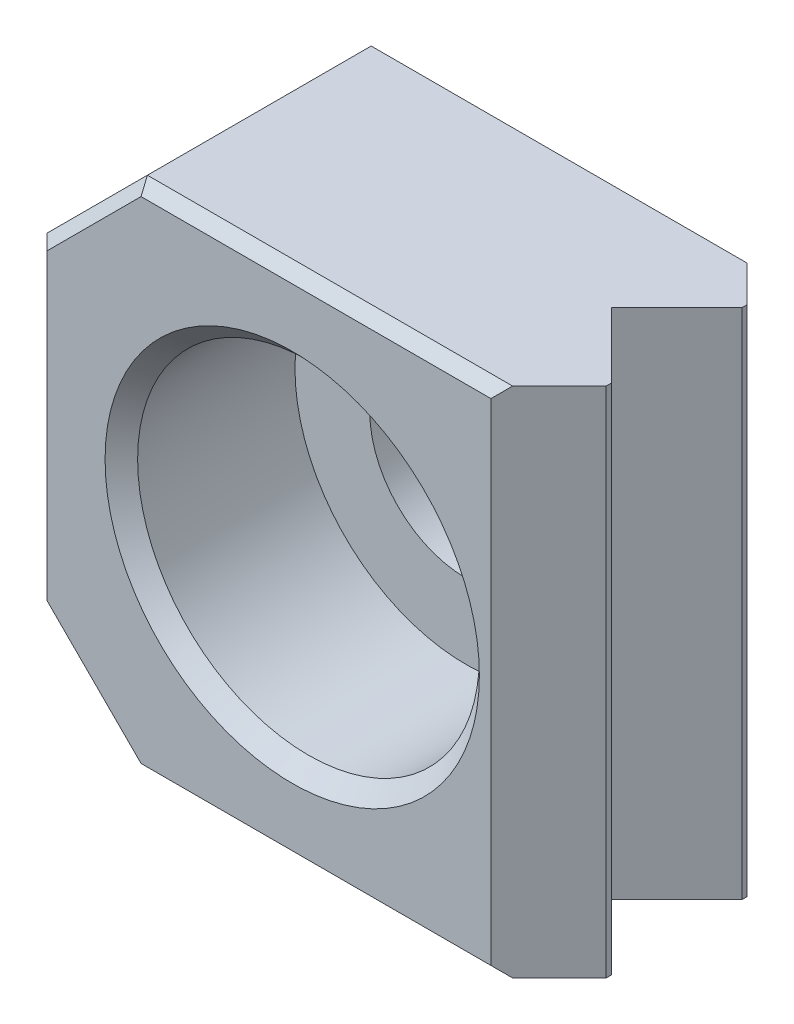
ISO-10303-21;
HEADER;
FILE_DESCRIPTION(('STEP AP214'),'2;1');
FILE_NAME('part.step','',(''),(''),'','','');
FILE_SCHEMA(('AUTOMOTIVE_DESIGN { 1 0 10303 214 1 1 1 1 }'));
ENDSEC;
DATA;
#1=APPLICATION_CONTEXT('core data for automotive mechanical design processes');
#2=APPLICATION_PROTOCOL_DEFINITION('international standard','automotive_design',2000,#1);
#3=PRODUCT_CONTEXT('',#1,'mechanical');
#4=PRODUCT('Part','Part','',(#3));
#5=PRODUCT_RELATED_PRODUCT_CATEGORY('part','',(#4));
#6=PRODUCT_DEFINITION_FORMATION('','',#4);
#7=PRODUCT_DEFINITION_CONTEXT('part definition',#1,'design');
#8=PRODUCT_DEFINITION('design','',#6,#7);
#9=PRODUCT_DEFINITION_SHAPE('','',#8);
#10=(LENGTH_UNIT() NAMED_UNIT(*) SI_UNIT(.MILLI.,.METRE.));
#11=(NAMED_UNIT(*) PLANE_ANGLE_UNIT() SI_UNIT($,.RADIAN.));
#12=(NAMED_UNIT(*) SI_UNIT($,.STERADIAN.) SOLID_ANGLE_UNIT());
#13=UNCERTAINTY_MEASURE_WITH_UNIT(LENGTH_MEASURE(1.E-05),#10,'distance_accuracy_value','');
#14=(GEOMETRIC_REPRESENTATION_CONTEXT(3) GLOBAL_UNCERTAINTY_ASSIGNED_CONTEXT((#13)) GLOBAL_UNIT_ASSIGNED_CONTEXT((#10,
#11,#12)) REPRESENTATION_CONTEXT('',''));
#15=CARTESIAN_POINT('',(0.,0.,0.));
#16=DIRECTION('',(0.,0.,1.));
#17=DIRECTION('',(1.,0.,0.));
#18=AXIS2_PLACEMENT_3D('',#15,#16,#17);
#19=CARTESIAN_POINT('',(6.,-6.,6.));
#20=DIRECTION('',(-1.,0.,0.));
#21=DIRECTION('',(0.,0.,-1.));
#22=AXIS2_PLACEMENT_3D('',#19,#20,#21);
#23=PLANE('',#22);
#24=DIRECTION('',(0.,-1.,0.));
#25=VECTOR('',#24,1.);
#26=CARTESIAN_POINT('',(6.,-6.,4.524));
#27=LINE('',#26,#25);
#28=CARTESIAN_POINT('',(6.,6.,4.524));
#29=VERTEX_POINT('',#28);
#30=CARTESIAN_POINT('',(6.,-6.,4.524));
#31=VERTEX_POINT('',#30);
#32=EDGE_CURVE('E149',#29,#31,#27,.T.);
#33=ORIENTED_EDGE('',*,*,#32,.F.);
#34=DIRECTION('',(0.,0.,-1.));
#35=VECTOR('',#34,1.);
#36=CARTESIAN_POINT('',(6.,6.,6.));
#37=LINE('',#36,#35);
#38=CARTESIAN_POINT('',(6.,6.,4.651));
#39=VERTEX_POINT('',#38);
#40=EDGE_CURVE('E198',#39,#29,#37,.T.);
#41=ORIENTED_EDGE('',*,*,#40,.F.);
#42=DIRECTION('',(0.,1.,0.));
#43=VECTOR('',#42,1.);
#44=CARTESIAN_POINT('',(6.,-6.,4.651));
#45=LINE('',#44,#43);
#46=CARTESIAN_POINT('',(6.,-6.,4.651));
#47=VERTEX_POINT('',#46);
#48=EDGE_CURVE('E182',#47,#39,#45,.T.);
#49=ORIENTED_EDGE('',*,*,#48,.F.);
#50=DIRECTION('',(0.,0.,-1.));
#51=VECTOR('',#50,1.);
#52=CARTESIAN_POINT('',(6.,-6.,6.));
#53=LINE('',#52,#51);
#54=EDGE_CURVE('E194',#47,#31,#53,.T.);
#55=ORIENTED_EDGE('',*,*,#54,.T.);
#56=EDGE_LOOP('',(#33,#41,#49,#55));
#57=FACE_BOUND('',#56,.T.);
#58=ADVANCED_FACE('F15',(#57),#23,.F.);
#59=CARTESIAN_POINT('',(6.,6.,1.476));
#60=VERTEX_POINT('',#59);
#61=CARTESIAN_POINT('',(6.,6.,1.349));
#62=VERTEX_POINT('',#61);
#63=EDGE_CURVE('E195',#60,#62,#37,.T.);
#64=ORIENTED_EDGE('',*,*,#63,.F.);
#65=DIRECTION('',(0.,-1.,0.));
#66=VECTOR('',#65,1.);
#67=CARTESIAN_POINT('',(6.,-6.,1.476));
#68=LINE('',#67,#66);
#69=CARTESIAN_POINT('',(6.,-6.,1.476));
#70=VERTEX_POINT('',#69);
#71=EDGE_CURVE('E185',#60,#70,#68,.T.);
#72=ORIENTED_EDGE('',*,*,#71,.T.);
#73=CARTESIAN_POINT('',(6.,-6.,1.349));
#74=VERTEX_POINT('',#73);
#75=EDGE_CURVE('E160',#70,#74,#53,.T.);
#76=ORIENTED_EDGE('',*,*,#75,.T.);
#77=DIRECTION('',(0.,1.,0.));
#78=VECTOR('',#77,1.);
#79=CARTESIAN_POINT('',(6.,-6.,1.349));
#80=LINE('',#79,#78);
#81=EDGE_CURVE('E142',#74,#62,#80,.T.);
#82=ORIENTED_EDGE('',*,*,#81,.T.);
#83=EDGE_LOOP('',(#64,#72,#76,#82));
#84=FACE_BOUND('',#83,.T.);
#85=ADVANCED_FACE('F328',(#84),#23,.F.);
#86=CARTESIAN_POINT('',(-6.,6.,6.));
#87=DIRECTION('',(0.,1.,0.));
#88=DIRECTION('',(-1.,0.,0.));
#89=AXIS2_PLACEMENT_3D('',#86,#87,#88);
#90=PLANE('',#89);
#91=DIRECTION('',(0.,0.,1.));
#92=VECTOR('',#91,1.);
#93=CARTESIAN_POINT('',(-3.64415,6.,6.));
#94=LINE('',#93,#92);
#95=CARTESIAN_POINT('',(-3.64415,6.,0.508));
#96=VERTEX_POINT('',#95);
#97=CARTESIAN_POINT('',(-3.64415,6.,5.746));
#98=VERTEX_POINT('',#97);
#99=EDGE_CURVE('E211',#96,#98,#94,.T.);
#100=ORIENTED_EDGE('',*,*,#99,.T.);
#101=DIRECTION('',(1.,0.,0.));
#102=VECTOR('',#101,1.);
#103=CARTESIAN_POINT('',(4.651,6.,5.746));
#104=LINE('',#103,#102);
#105=CARTESIAN_POINT('',(4.905,6.,5.746));
#106=VERTEX_POINT('',#105);
#107=EDGE_CURVE('E9',#98,#106,#104,.T.);
#108=ORIENTED_EDGE('',*,*,#107,.T.);
#109=DIRECTION('',(-0.707106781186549,0.,0.707106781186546));
#110=VECTOR('',#109,1.);
#111=CARTESIAN_POINT('',(6.0635,6.,4.5875));
#112=LINE('',#111,#110);
#113=EDGE_CURVE('E176',#39,#106,#112,.T.);
#114=ORIENTED_EDGE('',*,*,#113,.F.);
#115=ORIENTED_EDGE('',*,*,#40,.T.);
#116=DIRECTION('',(0.707106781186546,0.,0.707106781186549));
#117=VECTOR('',#116,1.);
#118=CARTESIAN_POINT('',(4.476,6.,3.));
#119=LINE('',#118,#117);
#120=CARTESIAN_POINT('',(4.476,6.,3.));
#121=VERTEX_POINT('',#120);
#122=EDGE_CURVE('E143',#121,#29,#119,.T.);
#123=ORIENTED_EDGE('',*,*,#122,.F.);
#124=DIRECTION('',(0.707106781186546,0.,-0.707106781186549));
#125=VECTOR('',#124,1.);
#126=CARTESIAN_POINT('',(4.476,6.,3.));
#127=LINE('',#126,#125);
#128=EDGE_CURVE('E139',#121,#60,#127,.T.);
#129=ORIENTED_EDGE('',*,*,#128,.T.);
#130=ORIENTED_EDGE('',*,*,#63,.T.);
#131=DIRECTION('',(-0.707106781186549,0.,-0.707106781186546));
#132=VECTOR('',#131,1.);
#133=CARTESIAN_POINT('',(6.0635,6.,1.4125));
#134=LINE('',#133,#132);
#135=CARTESIAN_POINT('',(5.159,6.,0.508));
#136=VERTEX_POINT('',#135);
#137=EDGE_CURVE('E173',#62,#136,#134,.T.);
#138=ORIENTED_EDGE('',*,*,#137,.T.);
#139=DIRECTION('',(-1.,0.,0.));
#140=VECTOR('',#139,1.);
#141=CARTESIAN_POINT('',(-6.,6.,0.508));
#142=LINE('',#141,#140);
#143=EDGE_CURVE('E250',#136,#96,#142,.T.);
#144=ORIENTED_EDGE('',*,*,#143,.T.);
#145=EDGE_LOOP('',(#100,#108,#114,#115,#123,#129,#130,#138,#144));
#146=FACE_BOUND('',#145,.T.);
#147=ADVANCED_FACE('F325',(#146),#90,.T.);
#148=CARTESIAN_POINT('',(6.,-6.,6.));
#149=DIRECTION('',(0.,-1.,0.));
#150=DIRECTION('',(1.,0.,0.));
#151=AXIS2_PLACEMENT_3D('',#148,#149,#150);
#152=PLANE('',#151);
#153=DIRECTION('',(-0.707106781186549,0.,0.707106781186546));
#154=VECTOR('',#153,1.);
#155=CARTESIAN_POINT('',(6.0635,-6.,4.5875));
#156=LINE('',#155,#154);
#157=CARTESIAN_POINT('',(4.905,-6.,5.746));
#158=VERTEX_POINT('',#157);
#159=EDGE_CURVE('E153',#47,#158,#156,.T.);
#160=ORIENTED_EDGE('',*,*,#159,.T.);
#161=DIRECTION('',(-1.,0.,0.));
#162=VECTOR('',#161,1.);
#163=CARTESIAN_POINT('',(-3.64415,-6.,5.746));
#164=LINE('',#163,#162);
#165=CARTESIAN_POINT('',(-3.64415,-6.,5.746));
#166=VERTEX_POINT('',#165);
#167=EDGE_CURVE('E252',#158,#166,#164,.T.);
#168=ORIENTED_EDGE('',*,*,#167,.T.);
#169=DIRECTION('',(0.,0.,-1.));
#170=VECTOR('',#169,1.);
#171=CARTESIAN_POINT('',(-3.64415,-6.,0.));
#172=LINE('',#171,#170);
#173=CARTESIAN_POINT('',(-3.64415,-6.,0.508));
#174=VERTEX_POINT('',#173);
#175=EDGE_CURVE('E205',#166,#174,#172,.T.);
#176=ORIENTED_EDGE('',*,*,#175,.T.);
#177=DIRECTION('',(1.,0.,0.));
#178=VECTOR('',#177,1.);
#179=CARTESIAN_POINT('',(6.,-6.,0.508));
#180=LINE('',#179,#178);
#181=CARTESIAN_POINT('',(5.159,-6.,0.508));
#182=VERTEX_POINT('',#181);
#183=EDGE_CURVE('E236',#174,#182,#180,.T.);
#184=ORIENTED_EDGE('',*,*,#183,.T.);
#185=DIRECTION('',(-0.707106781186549,0.,-0.707106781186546));
#186=VECTOR('',#185,1.);
#187=CARTESIAN_POINT('',(6.0635,-6.,1.4125));
#188=LINE('',#187,#186);
#189=EDGE_CURVE('E161',#74,#182,#188,.T.);
#190=ORIENTED_EDGE('',*,*,#189,.F.);
#191=ORIENTED_EDGE('',*,*,#75,.F.);
#192=DIRECTION('',(0.707106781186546,0.,-0.707106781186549));
#193=VECTOR('',#192,1.);
#194=CARTESIAN_POINT('',(4.476,-6.,3.));
#195=LINE('',#194,#193);
#196=CARTESIAN_POINT('',(4.476,-6.,3.));
#197=VERTEX_POINT('',#196);
#198=EDGE_CURVE('E136',#197,#70,#195,.T.);
#199=ORIENTED_EDGE('',*,*,#198,.F.);
#200=DIRECTION('',(0.707106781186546,0.,0.707106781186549));
#201=VECTOR('',#200,1.);
#202=CARTESIAN_POINT('',(4.476,-6.,3.));
#203=LINE('',#202,#201);
#204=EDGE_CURVE('E146',#197,#31,#203,.T.);
#205=ORIENTED_EDGE('',*,*,#204,.T.);
#206=ORIENTED_EDGE('',*,*,#54,.F.);
#207=EDGE_LOOP('',(#160,#168,#176,#184,#190,#191,#199,#205,#206));
#208=FACE_BOUND('',#207,.T.);
#209=ADVANCED_FACE('F157',(#208),#152,.T.);
#210=CARTESIAN_POINT('',(6.,6.,6.));
#211=DIRECTION('',(0.,0.,-1.));
#212=DIRECTION('',(1.,0.,0.));
#213=AXIS2_PLACEMENT_3D('',#210,#211,#212);
#214=PLANE('',#213);
#215=CARTESIAN_POINT('',(0.,0.,6.));
#216=DIRECTION('',(0.,0.,-1.));
#217=DIRECTION('',(1.,0.,0.));
#218=AXIS2_PLACEMENT_3D('',#215,#216,#217);
#219=CIRCLE('',#218,4.381);
#220=CARTESIAN_POINT('',(4.381,0.,6.));
#221=VERTEX_POINT('',#220);
#222=EDGE_CURVE('E216',#221,#221,#219,.T.);
#223=ORIENTED_EDGE('',*,*,#222,.T.);
#224=EDGE_LOOP('',(#223));
#225=FACE_BOUND('',#224,.T.);
#226=DIRECTION('',(0.707106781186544,-0.707106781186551,0.));
#227=VECTOR('',#226,1.);
#228=CARTESIAN_POINT('',(-3.4645448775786,-5.82039487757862,6.));
#229=LINE('',#228,#227);
#230=CARTESIAN_POINT('',(-5.746,-3.5389397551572,6.));
#231=VERTEX_POINT('',#230);
#232=CARTESIAN_POINT('',(-3.53893975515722,-5.746,6.));
#233=VERTEX_POINT('',#232);
#234=EDGE_CURVE('E261',#231,#233,#229,.T.);
#235=ORIENTED_EDGE('',*,*,#234,.T.);
#236=DIRECTION('',(1.,0.,0.));
#237=VECTOR('',#236,1.);
#238=CARTESIAN_POINT('',(4.651,-5.746,6.));
#239=LINE('',#238,#237);
#240=CARTESIAN_POINT('',(4.651,-5.746,6.));
#241=VERTEX_POINT('',#240);
#242=EDGE_CURVE('E263',#233,#241,#239,.T.);
#243=ORIENTED_EDGE('',*,*,#242,.T.);
#244=DIRECTION('',(0.,-1.,0.));
#245=VECTOR('',#244,1.);
#246=CARTESIAN_POINT('',(4.651,6.,6.));
#247=LINE('',#246,#245);
#248=CARTESIAN_POINT('',(4.651,5.746,6.));
#249=VERTEX_POINT('',#248);
#250=EDGE_CURVE('E202',#249,#241,#247,.T.);
#251=ORIENTED_EDGE('',*,*,#250,.F.);
#252=DIRECTION('',(-1.,0.,0.));
#253=VECTOR('',#252,1.);
#254=CARTESIAN_POINT('',(-3.64415,5.746,6.));
#255=LINE('',#254,#253);
#256=CARTESIAN_POINT('',(-3.53893975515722,5.746,6.));
#257=VERTEX_POINT('',#256);
#258=EDGE_CURVE('E255',#249,#257,#255,.T.);
#259=ORIENTED_EDGE('',*,*,#258,.T.);
#260=DIRECTION('',(-0.707106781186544,-0.707106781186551,0.));
#261=VECTOR('',#260,1.);
#262=CARTESIAN_POINT('',(-5.82039487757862,3.46454487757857,6.));
#263=LINE('',#262,#261);
#264=CARTESIAN_POINT('',(-5.746,3.5389397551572,6.));
#265=VERTEX_POINT('',#264);
#266=EDGE_CURVE('E257',#257,#265,#263,.T.);
#267=ORIENTED_EDGE('',*,*,#266,.T.);
#268=DIRECTION('',(0.,-1.,0.));
#269=VECTOR('',#268,1.);
#270=CARTESIAN_POINT('',(-5.746,6.,6.));
#271=LINE('',#270,#269);
#272=EDGE_CURVE('E259',#265,#231,#271,.T.);
#273=ORIENTED_EDGE('',*,*,#272,.T.);
#274=EDGE_LOOP('',(#235,#243,#251,#259,#267,#273));
#275=FACE_BOUND('',#274,.T.);
#276=ADVANCED_FACE('F368',(#225,#275),#214,.F.);
#277=CARTESIAN_POINT('',(-6.,6.,6.));
#278=DIRECTION('',(1.,0.,0.));
#279=DIRECTION('',(0.,0.,1.));
#280=AXIS2_PLACEMENT_3D('',#277,#278,#279);
#281=PLANE('',#280);
#282=DIRECTION('',(0.,0.,1.));
#283=VECTOR('',#282,1.);
#284=CARTESIAN_POINT('',(-6.,-3.64415,6.));
#285=LINE('',#284,#283);
#286=CARTESIAN_POINT('',(-6.,-3.64415,0.508));
#287=VERTEX_POINT('',#286);
#288=CARTESIAN_POINT('',(-6.,-3.64415,5.746));
#289=VERTEX_POINT('',#288);
#290=EDGE_CURVE('E209',#287,#289,#285,.T.);
#291=ORIENTED_EDGE('',*,*,#290,.T.);
#292=DIRECTION('',(0.,1.,0.));
#293=VECTOR('',#292,1.);
#294=CARTESIAN_POINT('',(-6.,6.,5.746));
#295=LINE('',#294,#293);
#296=CARTESIAN_POINT('',(-6.,3.64415,5.746));
#297=VERTEX_POINT('',#296);
#298=EDGE_CURVE('E36',#289,#297,#295,.T.);
#299=ORIENTED_EDGE('',*,*,#298,.T.);
#300=DIRECTION('',(0.,0.,-1.));
#301=VECTOR('',#300,1.);
#302=CARTESIAN_POINT('',(-6.,3.64415,0.));
#303=LINE('',#302,#301);
#304=CARTESIAN_POINT('',(-6.,3.64415,0.508));
#305=VERTEX_POINT('',#304);
#306=EDGE_CURVE('E207',#297,#305,#303,.T.);
#307=ORIENTED_EDGE('',*,*,#306,.T.);
#308=DIRECTION('',(0.,-1.,0.));
#309=VECTOR('',#308,1.);
#310=CARTESIAN_POINT('',(-6.,-3.64415,0.508));
#311=LINE('',#310,#309);
#312=EDGE_CURVE('E245',#305,#287,#311,.T.);
#313=ORIENTED_EDGE('',*,*,#312,.T.);
#314=EDGE_LOOP('',(#291,#299,#307,#313));
#315=FACE_BOUND('',#314,.T.);
#316=ADVANCED_FACE('F280',(#315),#281,.F.);
#317=CARTESIAN_POINT('',(6.,6.,0.));
#318=DIRECTION('',(0.,0.,-1.));
#319=DIRECTION('',(1.,0.,0.));
#320=AXIS2_PLACEMENT_3D('',#317,#318,#319);
#321=PLANE('',#320);
#322=CARTESIAN_POINT('',(0.,0.,0.));
#323=DIRECTION('',(0.,0.,-1.));
#324=DIRECTION('',(1.,0.,0.));
#325=AXIS2_PLACEMENT_3D('',#322,#323,#324);
#326=CIRCLE('',#325,2.631);
#327=CARTESIAN_POINT('',(2.631,0.,0.));
#328=VERTEX_POINT('',#327);
#329=EDGE_CURVE('E219',#328,#328,#326,.F.);
#330=ORIENTED_EDGE('',*,*,#329,.T.);
#331=EDGE_LOOP('',(#330));
#332=FACE_BOUND('',#331,.T.);
#333=DIRECTION('',(0.,1.,0.));
#334=VECTOR('',#333,1.);
#335=CARTESIAN_POINT('',(4.651,6.,0.));
#336=LINE('',#335,#334);
#337=CARTESIAN_POINT('',(4.651,-5.492,0.));
#338=VERTEX_POINT('',#337);
#339=CARTESIAN_POINT('',(4.651,5.492,0.));
#340=VERTEX_POINT('',#339);
#341=EDGE_CURVE('E199',#338,#340,#336,.T.);
#342=ORIENTED_EDGE('',*,*,#341,.F.);
#343=DIRECTION('',(-1.,0.,0.));
#344=VECTOR('',#343,1.);
#345=CARTESIAN_POINT('',(6.,-5.492,0.));
#346=LINE('',#345,#344);
#347=CARTESIAN_POINT('',(-3.43372951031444,-5.492,0.));
#348=VERTEX_POINT('',#347);
#349=EDGE_CURVE('E233',#338,#348,#346,.T.);
#350=ORIENTED_EDGE('',*,*,#349,.T.);
#351=DIRECTION('',(-0.707106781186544,0.707106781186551,0.));
#352=VECTOR('',#351,1.);
#353=CARTESIAN_POINT('',(-4.46286475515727,-4.46286475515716,0.));
#354=LINE('',#353,#352);
#355=CARTESIAN_POINT('',(-5.492,-3.43372951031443,0.));
#356=VERTEX_POINT('',#355);
#357=EDGE_CURVE('E231',#348,#356,#354,.T.);
#358=ORIENTED_EDGE('',*,*,#357,.T.);
#359=DIRECTION('',(0.,1.,0.));
#360=VECTOR('',#359,1.);
#361=CARTESIAN_POINT('',(-5.492,3.64415,0.));
#362=LINE('',#361,#360);
#363=CARTESIAN_POINT('',(-5.492,3.43372951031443,0.));
#364=VERTEX_POINT('',#363);
#365=EDGE_CURVE('E229',#356,#364,#362,.T.);
#366=ORIENTED_EDGE('',*,*,#365,.T.);
#367=DIRECTION('',(0.707106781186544,0.707106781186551,0.));
#368=VECTOR('',#367,1.);
#369=CARTESIAN_POINT('',(1.53713524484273,10.4628647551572,0.));
#370=LINE('',#369,#368);
#371=CARTESIAN_POINT('',(-3.43372951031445,5.492,0.));
#372=VERTEX_POINT('',#371);
#373=EDGE_CURVE('E227',#364,#372,#370,.T.);
#374=ORIENTED_EDGE('',*,*,#373,.T.);
#375=DIRECTION('',(1.,0.,0.));
#376=VECTOR('',#375,1.);
#377=CARTESIAN_POINT('',(6.,5.492,0.));
#378=LINE('',#377,#376);
#379=EDGE_CURVE('E225',#372,#340,#378,.T.);
#380=ORIENTED_EDGE('',*,*,#379,.T.);
#381=EDGE_LOOP('',(#342,#350,#358,#366,#374,#380));
#382=FACE_BOUND('',#381,.T.);
#383=ADVANCED_FACE('F317',(#332,#382),#321,.T.);
#384=CARTESIAN_POINT('',(0.,0.,1.936));
#385=DIRECTION('',(0.,0.,1.));
#386=DIRECTION('',(-1.,0.,0.));
#387=AXIS2_PLACEMENT_3D('',#384,#385,#386);
#388=CYLINDRICAL_SURFACE('',#387,4.);
#389=CARTESIAN_POINT('',(0.,0.,5.619));
#390=DIRECTION('',(0.,0.,-1.));
#391=DIRECTION('',(1.,0.,0.));
#392=AXIS2_PLACEMENT_3D('',#389,#390,#391);
#393=CIRCLE('',#392,4.);
#394=CARTESIAN_POINT('',(4.,0.,5.619));
#395=VERTEX_POINT('',#394);
#396=EDGE_CURVE('E213',#395,#395,#393,.F.);
#397=ORIENTED_EDGE('',*,*,#396,.T.);
#398=EDGE_LOOP('',(#397));
#399=FACE_BOUND('',#398,.T.);
#400=CARTESIAN_POINT('',(0.,0.,1.936));
#401=DIRECTION('',(0.,0.,1.));
#402=DIRECTION('',(-1.,0.,0.));
#403=AXIS2_PLACEMENT_3D('',#400,#401,#402);
#404=CIRCLE('',#403,4.);
#405=CARTESIAN_POINT('',(-4.,0.,1.936));
#406=VERTEX_POINT('',#405);
#407=EDGE_CURVE('E190',#406,#406,#404,.T.);
#408=ORIENTED_EDGE('',*,*,#407,.F.);
#409=EDGE_LOOP('',(#408));
#410=FACE_BOUND('',#409,.T.);
#411=ADVANCED_FACE('F548',(#399,#410),#388,.F.);
#412=CARTESIAN_POINT('',(0.,0.,1.936));
#413=DIRECTION('',(0.,0.,1.));
#414=DIRECTION('',(-1.,0.,0.));
#415=AXIS2_PLACEMENT_3D('',#412,#413,#414);
#416=PLANE('',#415);
#417=CARTESIAN_POINT('',(0.,0.,1.936));
#418=DIRECTION('',(0.,0.,1.));
#419=DIRECTION('',(-1.,0.,0.));
#420=AXIS2_PLACEMENT_3D('',#417,#418,#419);
#421=CIRCLE('',#420,2.25);
#422=CARTESIAN_POINT('',(-2.25,0.,1.936));
#423=VERTEX_POINT('',#422);
#424=EDGE_CURVE('E187',#423,#423,#421,.T.);
#425=ORIENTED_EDGE('',*,*,#424,.F.);
#426=EDGE_LOOP('',(#425));
#427=FACE_BOUND('',#426,.T.);
#428=ORIENTED_EDGE('',*,*,#407,.T.);
#429=EDGE_LOOP('',(#428));
#430=FACE_BOUND('',#429,.T.);
#431=ADVANCED_FACE('F538',(#427,#430),#416,.T.);
#432=CARTESIAN_POINT('',(0.,0.,0.));
#433=DIRECTION('',(0.,0.,1.));
#434=DIRECTION('',(-1.,0.,0.));
#435=AXIS2_PLACEMENT_3D('',#432,#433,#434);
#436=CYLINDRICAL_SURFACE('',#435,2.25);
#437=CARTESIAN_POINT('',(0.,0.,0.381));
#438=DIRECTION('',(0.,0.,-1.));
#439=DIRECTION('',(1.,0.,0.));
#440=AXIS2_PLACEMENT_3D('',#437,#438,#439);
#441=CIRCLE('',#440,2.25);
#442=CARTESIAN_POINT('',(2.25,0.,0.381));
#443=VERTEX_POINT('',#442);
#444=EDGE_CURVE('E222',#443,#443,#441,.T.);
#445=ORIENTED_EDGE('',*,*,#444,.T.);
#446=EDGE_LOOP('',(#445));
#447=FACE_BOUND('',#446,.T.);
#448=ORIENTED_EDGE('',*,*,#424,.T.);
#449=EDGE_LOOP('',(#448));
#450=FACE_BOUND('',#449,.T.);
#451=ADVANCED_FACE('F529',(#447,#450),#436,.F.);
#452=CARTESIAN_POINT('',(6.0635,6.,1.4125));
#453=DIRECTION('',(-0.707106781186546,0.,0.707106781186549));
#454=DIRECTION('',(-0.707106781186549,0.,-0.707106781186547));
#455=AXIS2_PLACEMENT_3D('',#452,#453,#454);
#456=PLANE('',#455);
#457=ORIENTED_EDGE('',*,*,#189,.T.);
#458=DIRECTION('',(0.577350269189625,-0.577350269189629,0.577350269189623));
#459=VECTOR('',#458,1.);
#460=CARTESIAN_POINT('',(5.10066666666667,-5.94166666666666,0.449666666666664));
#461=LINE('',#460,#459);
#462=EDGE_CURVE('E240',#182,#338,#461,.F.);
#463=ORIENTED_EDGE('',*,*,#462,.T.);
#464=ORIENTED_EDGE('',*,*,#341,.T.);
#465=DIRECTION('',(-0.577350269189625,-0.577350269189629,-0.577350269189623));
#466=VECTOR('',#465,1.);
#467=CARTESIAN_POINT('',(5.10066666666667,5.94166666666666,0.449666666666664));
#468=LINE('',#467,#466);
#469=EDGE_CURVE('E238',#340,#136,#468,.F.);
#470=ORIENTED_EDGE('',*,*,#469,.T.);
#471=ORIENTED_EDGE('',*,*,#137,.F.);
#472=ORIENTED_EDGE('',*,*,#81,.F.);
#473=EDGE_LOOP('',(#457,#463,#464,#470,#471,#472));
#474=FACE_BOUND('',#473,.T.);
#475=ADVANCED_FACE('F323',(#474),#456,.F.);
#476=CARTESIAN_POINT('',(6.0635,6.,4.5875));
#477=DIRECTION('',(0.707106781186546,0.,0.707106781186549));
#478=DIRECTION('',(-0.707106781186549,0.,0.707106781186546));
#479=AXIS2_PLACEMENT_3D('',#476,#477,#478);
#480=PLANE('',#479);
#481=ORIENTED_EDGE('',*,*,#250,.T.);
#482=DIRECTION('',(0.57735026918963,-0.57735026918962,-0.577350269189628));
#483=VECTOR('',#482,1.);
#484=CARTESIAN_POINT('',(1.67733333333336,-2.77233333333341,8.97366666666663));
#485=LINE('',#484,#483);
#486=EDGE_CURVE('E267',#241,#158,#485,.T.);
#487=ORIENTED_EDGE('',*,*,#486,.T.);
#488=ORIENTED_EDGE('',*,*,#159,.F.);
#489=ORIENTED_EDGE('',*,*,#48,.T.);
#490=ORIENTED_EDGE('',*,*,#113,.T.);
#491=DIRECTION('',(-0.57735026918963,-0.577350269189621,0.577350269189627));
#492=VECTOR('',#491,1.);
#493=CARTESIAN_POINT('',(5.67733333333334,6.77233333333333,4.97366666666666));
#494=LINE('',#493,#492);
#495=EDGE_CURVE('E265',#106,#249,#494,.T.);
#496=ORIENTED_EDGE('',*,*,#495,.T.);
#497=EDGE_LOOP('',(#481,#487,#488,#489,#490,#496));
#498=FACE_BOUND('',#497,.T.);
#499=ADVANCED_FACE('F361',(#498),#480,.T.);
#500=CARTESIAN_POINT('',(4.476,6.,3.));
#501=DIRECTION('',(-0.707106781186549,0.,-0.707106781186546));
#502=DIRECTION('',(0.707106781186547,0.,-0.707106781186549));
#503=AXIS2_PLACEMENT_3D('',#500,#501,#502);
#504=PLANE('',#503);
#505=ORIENTED_EDGE('',*,*,#128,.F.);
#506=DIRECTION('',(0.,-1.,0.));
#507=VECTOR('',#506,1.);
#508=CARTESIAN_POINT('',(4.476,6.,3.));
#509=LINE('',#508,#507);
#510=EDGE_CURVE('E132',#121,#197,#509,.T.);
#511=ORIENTED_EDGE('',*,*,#510,.T.);
#512=ORIENTED_EDGE('',*,*,#198,.T.);
#513=ORIENTED_EDGE('',*,*,#71,.F.);
#514=EDGE_LOOP('',(#505,#511,#512,#513));
#515=FACE_BOUND('',#514,.T.);
#516=ADVANCED_FACE('F134',(#515),#504,.F.);
#517=CARTESIAN_POINT('',(4.476,6.,3.));
#518=DIRECTION('',(0.707106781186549,0.,-0.707106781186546));
#519=DIRECTION('',(0.707106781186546,0.,0.707106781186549));
#520=AXIS2_PLACEMENT_3D('',#517,#518,#519);
#521=PLANE('',#520);
#522=ORIENTED_EDGE('',*,*,#32,.T.);
#523=ORIENTED_EDGE('',*,*,#204,.F.);
#524=ORIENTED_EDGE('',*,*,#510,.F.);
#525=ORIENTED_EDGE('',*,*,#122,.T.);
#526=EDGE_LOOP('',(#522,#523,#524,#525));
#527=FACE_BOUND('',#526,.T.);
#528=ADVANCED_FACE('F147',(#527),#521,.T.);
#529=CARTESIAN_POINT('',(-3.64415,-6.,6.));
#530=DIRECTION('',(-0.707106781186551,-0.707106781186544,0.));
#531=DIRECTION('',(0.707106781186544,-0.707106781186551,0.));
#532=AXIS2_PLACEMENT_3D('',#529,#530,#531);
#533=PLANE('',#532);
#534=ORIENTED_EDGE('',*,*,#175,.F.);
#535=DIRECTION('',(-0.707106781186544,0.707106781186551,0.));
#536=VECTOR('',#535,1.);
#537=CARTESIAN_POINT('',(-6.,-3.64415,5.746));
#538=LINE('',#537,#536);
#539=EDGE_CURVE('E269',#166,#289,#538,.T.);
#540=ORIENTED_EDGE('',*,*,#539,.T.);
#541=ORIENTED_EDGE('',*,*,#290,.F.);
#542=DIRECTION('',(0.707106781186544,-0.707106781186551,0.));
#543=VECTOR('',#542,1.);
#544=CARTESIAN_POINT('',(-3.64415,-6.,0.508));
#545=LINE('',#544,#543);
#546=EDGE_CURVE('E242',#287,#174,#545,.T.);
#547=ORIENTED_EDGE('',*,*,#546,.T.);
#548=EDGE_LOOP('',(#534,#540,#541,#547));
#549=FACE_BOUND('',#548,.T.);
#550=ADVANCED_FACE('F275',(#549),#533,.T.);
#551=CARTESIAN_POINT('',(-6.,3.64415,6.));
#552=DIRECTION('',(-0.707106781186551,0.707106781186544,0.));
#553=DIRECTION('',(-0.707106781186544,-0.707106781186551,0.));
#554=AXIS2_PLACEMENT_3D('',#551,#552,#553);
#555=PLANE('',#554);
#556=ORIENTED_EDGE('',*,*,#306,.F.);
#557=DIRECTION('',(0.707106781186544,0.707106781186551,0.));
#558=VECTOR('',#557,1.);
#559=CARTESIAN_POINT('',(-3.64415,6.,5.746));
#560=LINE('',#559,#558);
#561=EDGE_CURVE('E22',#297,#98,#560,.T.);
#562=ORIENTED_EDGE('',*,*,#561,.T.);
#563=ORIENTED_EDGE('',*,*,#99,.F.);
#564=DIRECTION('',(-0.707106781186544,-0.707106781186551,0.));
#565=VECTOR('',#564,1.);
#566=CARTESIAN_POINT('',(-6.,3.64415,0.508));
#567=LINE('',#566,#565);
#568=EDGE_CURVE('E247',#96,#305,#567,.T.);
#569=ORIENTED_EDGE('',*,*,#568,.T.);
#570=EDGE_LOOP('',(#556,#562,#563,#569));
#571=FACE_BOUND('',#570,.T.);
#572=ADVANCED_FACE('F479',(#571),#555,.T.);
#573=CARTESIAN_POINT('',(0.,0.,5.619));
#574=DIRECTION('',(0.,0.,1.));
#575=DIRECTION('',(-1.,0.,0.));
#576=AXIS2_PLACEMENT_3D('',#573,#574,#575);
#577=CONICAL_SURFACE('',#576,4.,0.785398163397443);
#578=ORIENTED_EDGE('',*,*,#222,.F.);
#579=EDGE_LOOP('',(#578));
#580=FACE_BOUND('',#579,.T.);
#581=ORIENTED_EDGE('',*,*,#396,.F.);
#582=EDGE_LOOP('',(#581));
#583=FACE_BOUND('',#582,.T.);
#584=ADVANCED_FACE('F469',(#580,#583),#577,.F.);
#585=CARTESIAN_POINT('',(0.,0.,0.));
#586=DIRECTION('',(0.,0.,-1.));
#587=DIRECTION('',(1.,0.,0.));
#588=AXIS2_PLACEMENT_3D('',#585,#586,#587);
#589=CONICAL_SURFACE('',#588,2.631,0.785398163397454);
#590=ORIENTED_EDGE('',*,*,#444,.F.);
#591=EDGE_LOOP('',(#590));
#592=FACE_BOUND('',#591,.T.);
#593=ORIENTED_EDGE('',*,*,#329,.F.);
#594=EDGE_LOOP('',(#593));
#595=FACE_BOUND('',#594,.T.);
#596=ADVANCED_FACE('F460',(#592,#595),#589,.F.);
#597=CARTESIAN_POINT('',(6.,5.492,0.));
#598=DIRECTION('',(0.,-0.707106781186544,0.707106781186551));
#599=DIRECTION('',(0.,-0.707106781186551,-0.707106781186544));
#600=AXIS2_PLACEMENT_3D('',#597,#598,#599);
#601=PLANE('',#600);
#602=ORIENTED_EDGE('',*,*,#469,.F.);
#603=ORIENTED_EDGE('',*,*,#379,.F.);
#604=DIRECTION('',(-0.281084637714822,0.67859834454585,0.678598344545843));
#605=VECTOR('',#604,1.);
#606=CARTESIAN_POINT('',(-2.68838399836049,3.69257675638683,-1.79942324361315));
#607=LINE('',#606,#605);
#608=EDGE_CURVE('E162',#96,#372,#607,.F.);
#609=ORIENTED_EDGE('',*,*,#608,.F.);
#610=ORIENTED_EDGE('',*,*,#143,.F.);
#611=EDGE_LOOP('',(#602,#603,#609,#610));
#612=FACE_BOUND('',#611,.T.);
#613=ADVANCED_FACE('F320',(#612),#601,.F.);
#614=CARTESIAN_POINT('',(1.53713524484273,10.4628647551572,0.));
#615=DIRECTION('',(0.5,-0.5,0.707106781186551));
#616=DIRECTION('',(-0.816496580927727,0.,0.577350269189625));
#617=AXIS2_PLACEMENT_3D('',#614,#615,#616);
#618=PLANE('',#617);
#619=ORIENTED_EDGE('',*,*,#608,.T.);
#620=ORIENTED_EDGE('',*,*,#373,.F.);
#621=DIRECTION('',(0.678598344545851,-0.281084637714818,-0.678598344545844));
#622=VECTOR('',#621,1.);
#623=CARTESIAN_POINT('',(-3.59587570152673,2.64832910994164,-1.89612429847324));
#624=LINE('',#623,#622);
#625=EDGE_CURVE('E167',#305,#364,#624,.T.);
#626=ORIENTED_EDGE('',*,*,#625,.F.);
#627=ORIENTED_EDGE('',*,*,#568,.F.);
#628=EDGE_LOOP('',(#619,#620,#626,#627));
#629=FACE_BOUND('',#628,.T.);
#630=ADVANCED_FACE('F312',(#629),#618,.F.);
#631=CARTESIAN_POINT('',(-6.,6.,0.508));
#632=DIRECTION('',(-0.707106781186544,0.,-0.707106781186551));
#633=DIRECTION('',(0.707106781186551,0.,-0.707106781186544));
#634=AXIS2_PLACEMENT_3D('',#631,#632,#633);
#635=PLANE('',#634);
#636=ORIENTED_EDGE('',*,*,#625,.T.);
#637=ORIENTED_EDGE('',*,*,#365,.F.);
#638=DIRECTION('',(0.678598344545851,0.28108463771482,-0.678598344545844));
#639=VECTOR('',#638,1.);
#640=CARTESIAN_POINT('',(-4.16044040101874,-2.88217946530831,-1.33155959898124));
#641=LINE('',#640,#639);
#642=EDGE_CURVE('E302',#287,#356,#641,.T.);
#643=ORIENTED_EDGE('',*,*,#642,.F.);
#644=ORIENTED_EDGE('',*,*,#312,.F.);
#645=EDGE_LOOP('',(#636,#637,#643,#644));
#646=FACE_BOUND('',#645,.T.);
#647=ADVANCED_FACE('F308',(#646),#635,.T.);
#648=CARTESIAN_POINT('',(-4.46286475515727,-4.46286475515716,0.));
#649=DIRECTION('',(0.5,0.5,0.707106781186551));
#650=DIRECTION('',(-0.816496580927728,0.,0.577350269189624));
#651=AXIS2_PLACEMENT_3D('',#648,#649,#650);
#652=PLANE('',#651);
#653=ORIENTED_EDGE('',*,*,#642,.T.);
#654=ORIENTED_EDGE('',*,*,#357,.F.);
#655=DIRECTION('',(-0.281084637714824,-0.67859834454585,0.678598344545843));
#656=VECTOR('',#655,1.);
#657=CARTESIAN_POINT('',(-3.31873908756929,-5.21438856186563,-0.277611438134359));
#658=LINE('',#657,#656);
#659=EDGE_CURVE('E300',#174,#348,#658,.F.);
#660=ORIENTED_EDGE('',*,*,#659,.F.);
#661=ORIENTED_EDGE('',*,*,#546,.F.);
#662=EDGE_LOOP('',(#653,#654,#660,#661));
#663=FACE_BOUND('',#662,.T.);
#664=ADVANCED_FACE('F338',(#663),#652,.F.);
#665=CARTESIAN_POINT('',(6.,-5.492,0.));
#666=DIRECTION('',(0.,0.707106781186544,0.707106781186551));
#667=DIRECTION('',(0.,-0.707106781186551,0.707106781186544));
#668=AXIS2_PLACEMENT_3D('',#665,#666,#667);
#669=PLANE('',#668);
#670=ORIENTED_EDGE('',*,*,#462,.F.);
#671=ORIENTED_EDGE('',*,*,#183,.F.);
#672=ORIENTED_EDGE('',*,*,#659,.T.);
#673=ORIENTED_EDGE('',*,*,#349,.F.);
#674=EDGE_LOOP('',(#670,#671,#672,#673));
#675=FACE_BOUND('',#674,.T.);
#676=ADVANCED_FACE('F333',(#675),#669,.F.);
#677=CARTESIAN_POINT('',(-6.,6.,5.746));
#678=DIRECTION('',(0.,0.707106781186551,0.707106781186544));
#679=DIRECTION('',(0.,-0.707106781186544,0.707106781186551));
#680=AXIS2_PLACEMENT_3D('',#677,#678,#679);
#681=PLANE('',#680);
#682=ORIENTED_EDGE('',*,*,#495,.F.);
#683=ORIENTED_EDGE('',*,*,#107,.F.);
#684=DIRECTION('',(0.281084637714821,-0.678598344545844,0.67859834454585));
#685=VECTOR('',#684,1.);
#686=CARTESIAN_POINT('',(-3.83028234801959,6.44936323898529,5.2966367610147));
#687=LINE('',#686,#685);
#688=EDGE_CURVE('E294',#257,#98,#687,.F.);
#689=ORIENTED_EDGE('',*,*,#688,.F.);
#690=ORIENTED_EDGE('',*,*,#258,.F.);
#691=EDGE_LOOP('',(#682,#683,#689,#690));
#692=FACE_BOUND('',#691,.T.);
#693=ADVANCED_FACE('F346',(#692),#681,.T.);
#694=CARTESIAN_POINT('',(1.35753012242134,10.6424698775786,6.));
#695=DIRECTION('',(-0.5,0.5,0.707106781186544));
#696=DIRECTION('',(-0.816496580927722,0.,-0.577350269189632));
#697=AXIS2_PLACEMENT_3D('',#694,#695,#696);
#698=PLANE('',#697);
#699=ORIENTED_EDGE('',*,*,#688,.T.);
#700=ORIENTED_EDGE('',*,*,#561,.F.);
#701=DIRECTION('',(-0.678598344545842,0.28108463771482,-0.678598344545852));
#702=VECTOR('',#701,1.);
#703=CARTESIAN_POINT('',(-3.82980752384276,2.74522684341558,7.91619247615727));
#704=LINE('',#703,#702);
#705=EDGE_CURVE('E290',#265,#297,#704,.T.);
#706=ORIENTED_EDGE('',*,*,#705,.F.);
#707=ORIENTED_EDGE('',*,*,#266,.F.);
#708=EDGE_LOOP('',(#699,#700,#706,#707));
#709=FACE_BOUND('',#708,.T.);
#710=ADVANCED_FACE('F383',(#709),#698,.T.);
#711=CARTESIAN_POINT('',(-5.746,6.,6.));
#712=DIRECTION('',(0.707106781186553,0.,-0.707106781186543));
#713=DIRECTION('',(0.707106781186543,0.,0.707106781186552));
#714=AXIS2_PLACEMENT_3D('',#711,#712,#713);
#715=PLANE('',#714);
#716=ORIENTED_EDGE('',*,*,#705,.T.);
#717=ORIENTED_EDGE('',*,*,#298,.F.);
#718=DIRECTION('',(-0.678598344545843,-0.281084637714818,-0.678598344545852));
#719=VECTOR('',#718,1.);
#720=CARTESIAN_POINT('',(-3.92650857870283,-2.7852817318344,7.8194914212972));
#721=LINE('',#720,#719);
#722=EDGE_CURVE('E287',#231,#289,#721,.T.);
#723=ORIENTED_EDGE('',*,*,#722,.F.);
#724=ORIENTED_EDGE('',*,*,#272,.F.);
#725=EDGE_LOOP('',(#716,#717,#723,#724));
#726=FACE_BOUND('',#725,.T.);
#727=ADVANCED_FACE('F285',(#726),#715,.F.);
#728=CARTESIAN_POINT('',(-4.64246987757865,-4.64246987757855,6.));
#729=DIRECTION('',(-0.500000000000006,-0.5,0.707106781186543));
#730=DIRECTION('',(-0.816496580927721,0.,-0.577350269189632));
#731=AXIS2_PLACEMENT_3D('',#728,#729,#730);
#732=PLANE('',#731);
#733=ORIENTED_EDGE('',*,*,#722,.T.);
#734=ORIENTED_EDGE('',*,*,#539,.F.);
#735=DIRECTION('',(0.281084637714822,0.678598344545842,0.678598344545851));
#736=VECTOR('',#735,1.);
#737=CARTESIAN_POINT('',(-3.41563682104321,-5.44832038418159,6.29767961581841));
#738=LINE('',#737,#736);
#739=EDGE_CURVE('E292',#233,#166,#738,.F.);
#740=ORIENTED_EDGE('',*,*,#739,.F.);
#741=ORIENTED_EDGE('',*,*,#234,.F.);
#742=EDGE_LOOP('',(#733,#734,#740,#741));
#743=FACE_BOUND('',#742,.T.);
#744=ADVANCED_FACE('F291',(#743),#732,.T.);
#745=CARTESIAN_POINT('',(6.,-6.,5.746));
#746=DIRECTION('',(0.,-0.707106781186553,0.707106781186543));
#747=DIRECTION('',(0.,-0.707106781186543,-0.707106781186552));
#748=AXIS2_PLACEMENT_3D('',#745,#746,#747);
#749=PLANE('',#748);
#750=ORIENTED_EDGE('',*,*,#486,.F.);
#751=ORIENTED_EDGE('',*,*,#242,.F.);
#752=ORIENTED_EDGE('',*,*,#739,.T.);
#753=ORIENTED_EDGE('',*,*,#167,.F.);
#754=EDGE_LOOP('',(#750,#751,#752,#753));
#755=FACE_BOUND('',#754,.T.);
#756=ADVANCED_FACE('F373',(#755),#749,.T.);
#757=CLOSED_SHELL('',(#58,#85,#147,#209,#276,#316,#383,#411,#431,#451,#475,#499,#516,#528,#550,
#572,#584,#596,#613,#630,#647,#664,#676,#693,#710,#727,#744,#756));
#758=MANIFOLD_SOLID_BREP('B1',#757);
#759=ADVANCED_BREP_SHAPE_REPRESENTATION('',(#18,#758),#14);
#760=SHAPE_DEFINITION_REPRESENTATION(#9,#759);
ENDSEC;
END-ISO-10303-21;
